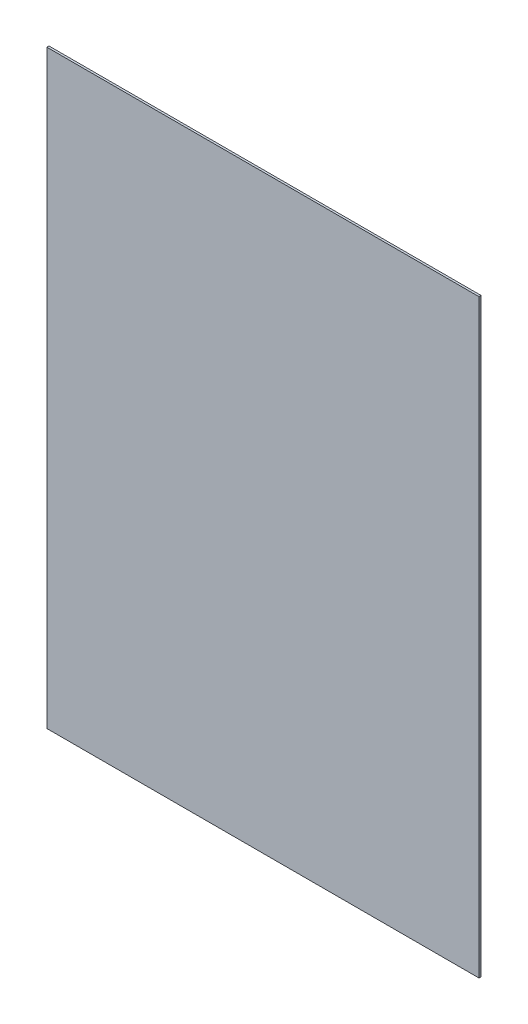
from build123d import *

# Parameters (mm, degrees)
SCHIZZO1_W                   = 820
SCHIZZO1_H                   = 1120
ESTRUSIONE_ESTRUSIONE1_DEPTH = 4


with BuildPart() as part:
    # Schizzo1 → Estrusione-Estrusione1 (new body)
    with BuildSketch(Plane.XY):
        Rectangle(SCHIZZO1_W, SCHIZZO1_H)
    extrude(amount=ESTRUSIONE_ESTRUSIONE1_DEPTH)


solid = part.part
